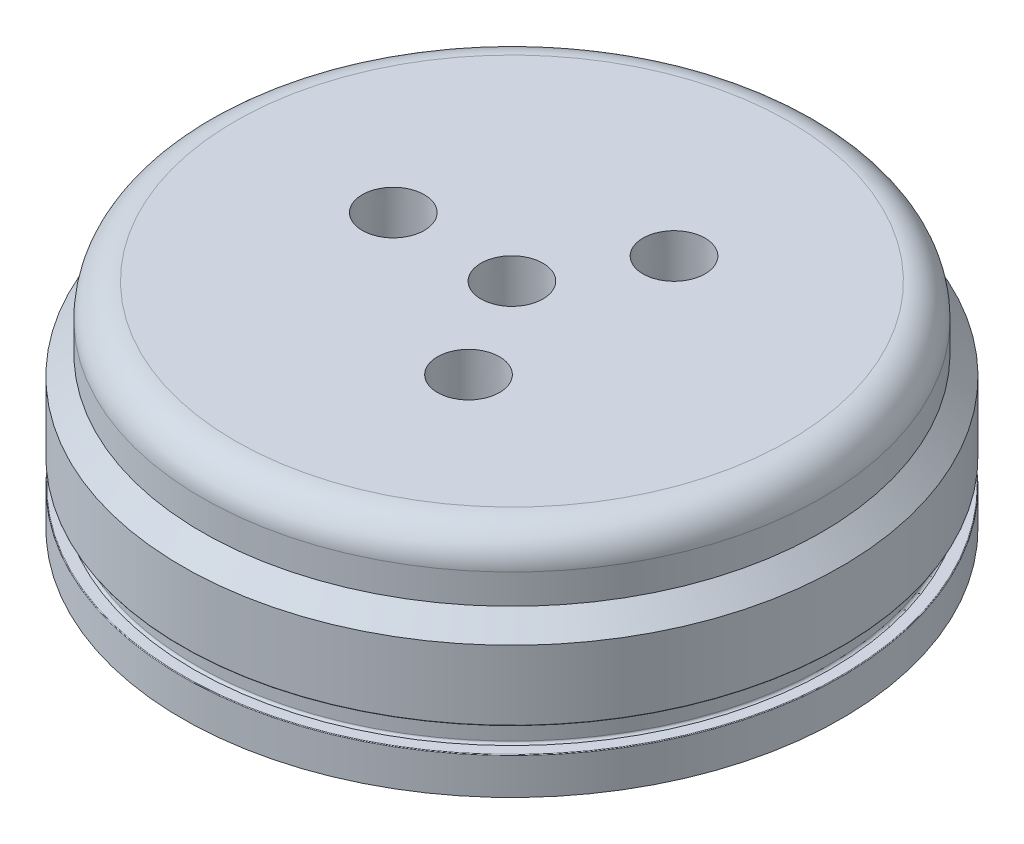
ISO-10303-21;
HEADER;
FILE_DESCRIPTION(('STEP AP214'),'2;1');
FILE_NAME('part.step','',(''),(''),'','','');
FILE_SCHEMA(('AUTOMOTIVE_DESIGN { 1 0 10303 214 1 1 1 1 }'));
ENDSEC;
DATA;
#1=APPLICATION_CONTEXT('core data for automotive mechanical design processes');
#2=APPLICATION_PROTOCOL_DEFINITION('international standard','automotive_design',2000,#1);
#3=PRODUCT_CONTEXT('',#1,'mechanical');
#4=PRODUCT('Part','Part','',(#3));
#5=PRODUCT_RELATED_PRODUCT_CATEGORY('part','',(#4));
#6=PRODUCT_DEFINITION_FORMATION('','',#4);
#7=PRODUCT_DEFINITION_CONTEXT('part definition',#1,'design');
#8=PRODUCT_DEFINITION('design','',#6,#7);
#9=PRODUCT_DEFINITION_SHAPE('','',#8);
#10=(LENGTH_UNIT() NAMED_UNIT(*) SI_UNIT(.MILLI.,.METRE.));
#11=(NAMED_UNIT(*) PLANE_ANGLE_UNIT() SI_UNIT($,.RADIAN.));
#12=(NAMED_UNIT(*) SI_UNIT($,.STERADIAN.) SOLID_ANGLE_UNIT());
#13=UNCERTAINTY_MEASURE_WITH_UNIT(LENGTH_MEASURE(1.E-05),#10,'distance_accuracy_value','');
#14=(GEOMETRIC_REPRESENTATION_CONTEXT(3) GLOBAL_UNCERTAINTY_ASSIGNED_CONTEXT((#13)) GLOBAL_UNIT_ASSIGNED_CONTEXT((#10,
#11,#12)) REPRESENTATION_CONTEXT('',''));
#15=CARTESIAN_POINT('',(0.,0.,0.));
#16=DIRECTION('',(0.,0.,1.));
#17=DIRECTION('',(1.,0.,0.));
#18=AXIS2_PLACEMENT_3D('',#15,#16,#17);
#19=CARTESIAN_POINT('',(-59.69,41.275,0.));
#20=DIRECTION('',(0.,-1.,0.));
#21=DIRECTION('',(0.,0.,-1.));
#22=AXIS2_PLACEMENT_3D('',#19,#20,#21);
#23=PLANE('',#22);
#24=CARTESIAN_POINT('',(0.,41.275,0.));
#25=DIRECTION('',(0.,-1.,0.));
#26=DIRECTION('',(0.,0.,-1.));
#27=AXIS2_PLACEMENT_3D('',#24,#25,#26);
#28=CIRCLE('',#27,5.97790349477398);
#29=CARTESIAN_POINT('',(0.,41.275,-5.97790349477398));
#30=VERTEX_POINT('',#29);
#31=EDGE_CURVE('E51',#30,#30,#28,.T.);
#32=ORIENTED_EDGE('',*,*,#31,.T.);
#33=EDGE_LOOP('',(#32));
#34=FACE_BOUND('',#33,.T.);
#35=CARTESIAN_POINT('',(0.,41.275,0.));
#36=DIRECTION('',(0.,-1.,0.));
#37=DIRECTION('',(0.,0.,-1.));
#38=AXIS2_PLACEMENT_3D('',#35,#36,#37);
#39=CIRCLE('',#38,53.34);
#40=CARTESIAN_POINT('',(0.,41.275,-53.34));
#41=VERTEX_POINT('',#40);
#42=EDGE_CURVE('E11',#41,#41,#39,.F.);
#43=ORIENTED_EDGE('',*,*,#42,.T.);
#44=EDGE_LOOP('',(#43));
#45=FACE_BOUND('',#44,.T.);
#46=CARTESIAN_POINT('',(11.4299999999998,41.275,19.7973407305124));
#47=DIRECTION('',(0.,-1.,0.));
#48=DIRECTION('',(0.,0.,-1.));
#49=AXIS2_PLACEMENT_3D('',#46,#47,#48);
#50=CIRCLE('',#49,5.97790349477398);
#51=CARTESIAN_POINT('',(11.4299999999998,41.275,13.8194372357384));
#52=VERTEX_POINT('',#51);
#53=EDGE_CURVE('E177',#52,#52,#50,.T.);
#54=ORIENTED_EDGE('',*,*,#53,.T.);
#55=EDGE_LOOP('',(#54));
#56=FACE_BOUND('',#55,.T.);
#57=CARTESIAN_POINT('',(11.4300000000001,41.275,-19.7973407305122));
#58=DIRECTION('',(0.,-1.,0.));
#59=DIRECTION('',(0.,0.,-1.));
#60=AXIS2_PLACEMENT_3D('',#57,#58,#59);
#61=CIRCLE('',#60,5.97790349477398);
#62=CARTESIAN_POINT('',(11.4300000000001,41.275,-25.7752442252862));
#63=VERTEX_POINT('',#62);
#64=EDGE_CURVE('E181',#63,#63,#61,.T.);
#65=ORIENTED_EDGE('',*,*,#64,.T.);
#66=EDGE_LOOP('',(#65));
#67=FACE_BOUND('',#66,.T.);
#68=CARTESIAN_POINT('',(-22.86,41.275,0.));
#69=DIRECTION('',(0.,-1.,0.));
#70=DIRECTION('',(0.,0.,-1.));
#71=AXIS2_PLACEMENT_3D('',#68,#69,#70);
#72=CIRCLE('',#71,5.97790349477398);
#73=CARTESIAN_POINT('',(-22.86,41.275,-5.97790349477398));
#74=VERTEX_POINT('',#73);
#75=EDGE_CURVE('E187',#74,#74,#72,.T.);
#76=ORIENTED_EDGE('',*,*,#75,.T.);
#77=EDGE_LOOP('',(#76));
#78=FACE_BOUND('',#77,.T.);
#79=ADVANCED_FACE('F47',(#34,#45,#56,#67,#78),#23,.F.);
#80=CARTESIAN_POINT('',(-55.7784,0.,0.));
#81=DIRECTION('',(0.,1.,0.));
#82=DIRECTION('',(0.,0.,1.));
#83=AXIS2_PLACEMENT_3D('',#80,#81,#82);
#84=PLANE('',#83);
#85=CARTESIAN_POINT('',(-8.85182948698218,0.,58.0666773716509));
#86=DIRECTION('',(0.,-1.,0.));
#87=DIRECTION('',(0.,0.,-1.));
#88=AXIS2_PLACEMENT_3D('',#85,#86,#87);
#89=CIRCLE('',#88,1.72719999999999);
#90=CARTESIAN_POINT('',(-8.85182948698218,0.,56.3394773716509));
#91=VERTEX_POINT('',#90);
#92=EDGE_CURVE('E103',#91,#91,#89,.T.);
#93=ORIENTED_EDGE('',*,*,#92,.F.);
#94=EDGE_LOOP('',(#93));
#95=FACE_BOUND('',#94,.T.);
#96=CARTESIAN_POINT('',(52.4893261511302,0.,26.3621802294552));
#97=DIRECTION('',(0.,-1.,0.));
#98=DIRECTION('',(0.,0.,-1.));
#99=AXIS2_PLACEMENT_3D('',#96,#97,#98);
#100=CIRCLE('',#99,1.72719999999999);
#101=CARTESIAN_POINT('',(52.4893261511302,0.,24.6349802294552));
#102=VERTEX_POINT('',#101);
#103=EDGE_CURVE('E124',#102,#102,#100,.T.);
#104=ORIENTED_EDGE('',*,*,#103,.F.);
#105=EDGE_LOOP('',(#104));
#106=FACE_BOUND('',#105,.T.);
#107=CARTESIAN_POINT('',(52.4893261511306,0.,-26.3621802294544));
#108=DIRECTION('',(0.,-1.,0.));
#109=DIRECTION('',(0.,0.,-1.));
#110=AXIS2_PLACEMENT_3D('',#107,#108,#109);
#111=CIRCLE('',#110,1.72719999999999);
#112=CARTESIAN_POINT('',(52.4893261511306,0.,-28.0893802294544));
#113=VERTEX_POINT('',#112);
#114=EDGE_CURVE('E132',#113,#113,#111,.T.);
#115=ORIENTED_EDGE('',*,*,#114,.F.);
#116=EDGE_LOOP('',(#115));
#117=FACE_BOUND('',#116,.T.);
#118=CARTESIAN_POINT('',(41.2920170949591,0.,-41.7739539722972));
#119=DIRECTION('',(0.,-1.,0.));
#120=DIRECTION('',(0.,0.,-1.));
#121=AXIS2_PLACEMENT_3D('',#118,#119,#120);
#122=CIRCLE('',#121,1.72719999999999);
#123=CARTESIAN_POINT('',(41.2920170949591,0.,-43.5011539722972));
#124=VERTEX_POINT('',#123);
#125=EDGE_CURVE('E138',#124,#124,#122,.T.);
#126=ORIENTED_EDGE('',*,*,#125,.F.);
#127=EDGE_LOOP('',(#126));
#128=FACE_BOUND('',#127,.T.);
#129=CARTESIAN_POINT('',(-8.85182948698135,0.,-58.066677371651));
#130=DIRECTION('',(0.,-1.,0.));
#131=DIRECTION('',(0.,0.,-1.));
#132=AXIS2_PLACEMENT_3D('',#129,#130,#131);
#133=CIRCLE('',#132,1.72719999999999);
#134=CARTESIAN_POINT('',(-8.85182948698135,0.,-59.793877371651));
#135=VERTEX_POINT('',#134);
#136=EDGE_CURVE('E144',#135,#135,#133,.T.);
#137=ORIENTED_EDGE('',*,*,#136,.F.);
#138=EDGE_LOOP('',(#137));
#139=FACE_BOUND('',#138,.T.);
#140=CARTESIAN_POINT('',(-26.9694561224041,0.,-52.1799036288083));
#141=DIRECTION('',(0.,-1.,0.));
#142=DIRECTION('',(0.,0.,-1.));
#143=AXIS2_PLACEMENT_3D('',#140,#141,#142);
#144=CIRCLE('',#143,1.72719999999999);
#145=CARTESIAN_POINT('',(-26.9694561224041,0.,-53.9071036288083));
#146=VERTEX_POINT('',#145);
#147=EDGE_CURVE('E150',#146,#146,#144,.T.);
#148=ORIENTED_EDGE('',*,*,#147,.F.);
#149=EDGE_LOOP('',(#148));
#150=FACE_BOUND('',#149,.T.);
#151=CARTESIAN_POINT('',(-57.9600576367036,0.,-9.525));
#152=DIRECTION('',(0.,-1.,0.));
#153=DIRECTION('',(0.,0.,-1.));
#154=AXIS2_PLACEMENT_3D('',#151,#152,#153);
#155=CIRCLE('',#154,1.72719999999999);
#156=CARTESIAN_POINT('',(-57.9600576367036,0.,-11.2522));
#157=VERTEX_POINT('',#156);
#158=EDGE_CURVE('E157',#157,#157,#155,.T.);
#159=ORIENTED_EDGE('',*,*,#158,.F.);
#160=EDGE_LOOP('',(#159));
#161=FACE_BOUND('',#160,.T.);
#162=CARTESIAN_POINT('',(-57.9600576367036,0.,9.525));
#163=DIRECTION('',(0.,-1.,0.));
#164=DIRECTION('',(0.,0.,-1.));
#165=AXIS2_PLACEMENT_3D('',#162,#163,#164);
#166=CIRCLE('',#165,1.72719999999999);
#167=CARTESIAN_POINT('',(-57.9600576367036,0.,7.79780000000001));
#168=VERTEX_POINT('',#167);
#169=EDGE_CURVE('E165',#168,#168,#166,.T.);
#170=ORIENTED_EDGE('',*,*,#169,.F.);
#171=EDGE_LOOP('',(#170));
#172=FACE_BOUND('',#171,.T.);
#173=CARTESIAN_POINT('',(0.,0.,0.));
#174=DIRECTION('',(0.,-1.,0.));
#175=DIRECTION('',(0.,0.,-1.));
#176=AXIS2_PLACEMENT_3D('',#173,#174,#175);
#177=CIRCLE('',#176,55.7784);
#178=CARTESIAN_POINT('',(0.,0.,-55.7784));
#179=VERTEX_POINT('',#178);
#180=EDGE_CURVE('E207',#179,#179,#177,.T.);
#181=ORIENTED_EDGE('',*,*,#180,.F.);
#182=EDGE_LOOP('',(#181));
#183=FACE_BOUND('',#182,.T.);
#184=CARTESIAN_POINT('',(0.,0.,0.));
#185=DIRECTION('',(0.,-1.,0.));
#186=DIRECTION('',(0.,0.,-1.));
#187=AXIS2_PLACEMENT_3D('',#184,#185,#186);
#188=CIRCLE('',#187,63.5);
#189=CARTESIAN_POINT('',(0.,0.,-63.5));
#190=VERTEX_POINT('',#189);
#191=EDGE_CURVE('E203',#190,#190,#188,.T.);
#192=ORIENTED_EDGE('',*,*,#191,.T.);
#193=EDGE_LOOP('',(#192));
#194=FACE_BOUND('',#193,.T.);
#195=CARTESIAN_POINT('',(41.2920170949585,0.,41.7739539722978));
#196=DIRECTION('',(0.,-1.,0.));
#197=DIRECTION('',(0.,0.,-1.));
#198=AXIS2_PLACEMENT_3D('',#195,#196,#197);
#199=CIRCLE('',#198,1.72719999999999);
#200=CARTESIAN_POINT('',(41.2920170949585,0.,40.0467539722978));
#201=VERTEX_POINT('',#200);
#202=EDGE_CURVE('E116',#201,#201,#199,.T.);
#203=ORIENTED_EDGE('',*,*,#202,.F.);
#204=EDGE_LOOP('',(#203));
#205=FACE_BOUND('',#204,.T.);
#206=CARTESIAN_POINT('',(-26.9694561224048,0.,52.1799036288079));
#207=DIRECTION('',(0.,-1.,0.));
#208=DIRECTION('',(0.,0.,-1.));
#209=AXIS2_PLACEMENT_3D('',#206,#207,#208);
#210=CIRCLE('',#209,1.72719999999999);
#211=CARTESIAN_POINT('',(-26.9694561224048,0.,50.4527036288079));
#212=VERTEX_POINT('',#211);
#213=EDGE_CURVE('E104',#212,#212,#210,.T.);
#214=ORIENTED_EDGE('',*,*,#213,.F.);
#215=EDGE_LOOP('',(#214));
#216=FACE_BOUND('',#215,.T.);
#217=ADVANCED_FACE('F272',(#95,#106,#117,#128,#139,#150,#161,#172,#183,#194,#205,#216),#84,.F.);
#218=CARTESIAN_POINT('',(0.,7.5565,0.));
#219=DIRECTION('',(0.,-1.,0.));
#220=DIRECTION('',(0.,0.,-1.));
#221=AXIS2_PLACEMENT_3D('',#218,#219,#220);
#222=TOROIDAL_SURFACE('',#221,61.3029,0.4445);
#223=CARTESIAN_POINT('',(0.,7.112,0.));
#224=DIRECTION('',(0.,-1.,0.));
#225=DIRECTION('',(0.,0.,-1.));
#226=AXIS2_PLACEMENT_3D('',#223,#224,#225);
#227=CIRCLE('',#226,61.3029);
#228=CARTESIAN_POINT('',(0.,7.112,-61.3029));
#229=VERTEX_POINT('',#228);
#230=EDGE_CURVE('E191',#229,#229,#227,.T.);
#231=ORIENTED_EDGE('',*,*,#230,.F.);
#232=EDGE_LOOP('',(#231));
#233=FACE_BOUND('',#232,.T.);
#234=CARTESIAN_POINT('',(0.,7.5565,0.));
#235=DIRECTION('',(0.,-1.,0.));
#236=DIRECTION('',(0.,0.,-1.));
#237=AXIS2_PLACEMENT_3D('',#234,#235,#236);
#238=CIRCLE('',#237,60.8584);
#239=CARTESIAN_POINT('',(0.,7.5565,-60.8584));
#240=VERTEX_POINT('',#239);
#241=EDGE_CURVE('E243',#240,#240,#238,.T.);
#242=ORIENTED_EDGE('',*,*,#241,.T.);
#243=EDGE_LOOP('',(#242));
#244=FACE_BOUND('',#243,.T.);
#245=ADVANCED_FACE('F278',(#233,#244),#222,.F.);
#246=CARTESIAN_POINT('',(0.,0.,0.));
#247=DIRECTION('',(0.,-1.,0.));
#248=DIRECTION('',(0.,0.,-1.));
#249=AXIS2_PLACEMENT_3D('',#246,#247,#248);
#250=CYLINDRICAL_SURFACE('',#249,60.8584);
#251=ORIENTED_EDGE('',*,*,#241,.F.);
#252=EDGE_LOOP('',(#251));
#253=FACE_BOUND('',#252,.T.);
#254=CARTESIAN_POINT('',(0.,11.4935,0.));
#255=DIRECTION('',(0.,-1.,0.));
#256=DIRECTION('',(0.,0.,-1.));
#257=AXIS2_PLACEMENT_3D('',#254,#255,#256);
#258=CIRCLE('',#257,60.8584);
#259=CARTESIAN_POINT('',(0.,11.4935,-60.8584));
#260=VERTEX_POINT('',#259);
#261=EDGE_CURVE('E239',#260,#260,#258,.T.);
#262=ORIENTED_EDGE('',*,*,#261,.T.);
#263=EDGE_LOOP('',(#262));
#264=FACE_BOUND('',#263,.T.);
#265=ADVANCED_FACE('F308',(#253,#264),#250,.T.);
#266=CARTESIAN_POINT('',(0.,11.4935,0.));
#267=DIRECTION('',(0.,-1.,0.));
#268=DIRECTION('',(0.,0.,-1.));
#269=AXIS2_PLACEMENT_3D('',#266,#267,#268);
#270=TOROIDAL_SURFACE('',#269,61.3029,0.4445);
#271=ORIENTED_EDGE('',*,*,#261,.F.);
#272=EDGE_LOOP('',(#271));
#273=FACE_BOUND('',#272,.T.);
#274=CARTESIAN_POINT('',(0.,11.938,0.));
#275=DIRECTION('',(0.,-1.,0.));
#276=DIRECTION('',(0.,0.,-1.));
#277=AXIS2_PLACEMENT_3D('',#274,#275,#276);
#278=CIRCLE('',#277,61.3029);
#279=CARTESIAN_POINT('',(0.,11.938,-61.3029));
#280=VERTEX_POINT('',#279);
#281=EDGE_CURVE('E235',#280,#280,#278,.T.);
#282=ORIENTED_EDGE('',*,*,#281,.T.);
#283=EDGE_LOOP('',(#282));
#284=FACE_BOUND('',#283,.T.);
#285=ADVANCED_FACE('F304',(#273,#284),#270,.F.);
#286=CARTESIAN_POINT('',(-63.373,11.938,0.));
#287=DIRECTION('',(0.,1.,0.));
#288=DIRECTION('',(0.,0.,1.));
#289=AXIS2_PLACEMENT_3D('',#286,#287,#288);
#290=PLANE('',#289);
#291=ORIENTED_EDGE('',*,*,#281,.F.);
#292=EDGE_LOOP('',(#291));
#293=FACE_BOUND('',#292,.T.);
#294=CARTESIAN_POINT('',(0.,11.938,0.));
#295=DIRECTION('',(0.,-1.,0.));
#296=DIRECTION('',(0.,0.,-1.));
#297=AXIS2_PLACEMENT_3D('',#294,#295,#296);
#298=CIRCLE('',#297,63.373);
#299=CARTESIAN_POINT('',(0.,11.938,-63.373));
#300=VERTEX_POINT('',#299);
#301=EDGE_CURVE('E231',#300,#300,#298,.T.);
#302=ORIENTED_EDGE('',*,*,#301,.T.);
#303=EDGE_LOOP('',(#302));
#304=FACE_BOUND('',#303,.T.);
#305=ADVANCED_FACE('F300',(#293,#304),#290,.F.);
#306=CARTESIAN_POINT('',(0.,12.065,0.));
#307=DIRECTION('',(0.,-1.,0.));
#308=DIRECTION('',(0.,0.,-1.));
#309=AXIS2_PLACEMENT_3D('',#306,#307,#308);
#310=TOROIDAL_SURFACE('',#309,63.373,0.127);
#311=ORIENTED_EDGE('',*,*,#301,.F.);
#312=EDGE_LOOP('',(#311));
#313=FACE_BOUND('',#312,.T.);
#314=CARTESIAN_POINT('',(0.,12.065,0.));
#315=DIRECTION('',(0.,-1.,0.));
#316=DIRECTION('',(0.,0.,-1.));
#317=AXIS2_PLACEMENT_3D('',#314,#315,#316);
#318=CIRCLE('',#317,63.5);
#319=CARTESIAN_POINT('',(0.,12.065,-63.5));
#320=VERTEX_POINT('',#319);
#321=EDGE_CURVE('E227',#320,#320,#318,.T.);
#322=ORIENTED_EDGE('',*,*,#321,.T.);
#323=EDGE_LOOP('',(#322));
#324=FACE_BOUND('',#323,.T.);
#325=ADVANCED_FACE('F296',(#313,#324),#310,.T.);
#326=CARTESIAN_POINT('',(0.,0.,0.));
#327=DIRECTION('',(0.,-1.,0.));
#328=DIRECTION('',(0.,0.,-1.));
#329=AXIS2_PLACEMENT_3D('',#326,#327,#328);
#330=CYLINDRICAL_SURFACE('',#329,63.5);
#331=ORIENTED_EDGE('',*,*,#321,.F.);
#332=EDGE_LOOP('',(#331));
#333=FACE_BOUND('',#332,.T.);
#334=CARTESIAN_POINT('',(0.,25.4,0.));
#335=DIRECTION('',(0.,-1.,0.));
#336=DIRECTION('',(0.,0.,-1.));
#337=AXIS2_PLACEMENT_3D('',#334,#335,#336);
#338=CIRCLE('',#337,63.5);
#339=CARTESIAN_POINT('',(0.,25.4,-63.5));
#340=VERTEX_POINT('',#339);
#341=EDGE_CURVE('E223',#340,#340,#338,.T.);
#342=ORIENTED_EDGE('',*,*,#341,.T.);
#343=EDGE_LOOP('',(#342));
#344=FACE_BOUND('',#343,.T.);
#345=ADVANCED_FACE('F292',(#333,#344),#330,.T.);
#346=CARTESIAN_POINT('',(0.,29.21,0.));
#347=DIRECTION('',(0.,-1.,0.));
#348=DIRECTION('',(0.,0.,-1.));
#349=AXIS2_PLACEMENT_3D('',#346,#347,#348);
#350=CONICAL_SURFACE('',#349,59.69,0.78539816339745);
#351=ORIENTED_EDGE('',*,*,#341,.F.);
#352=EDGE_LOOP('',(#351));
#353=FACE_BOUND('',#352,.T.);
#354=CARTESIAN_POINT('',(0.,29.21,0.));
#355=DIRECTION('',(0.,-1.,0.));
#356=DIRECTION('',(0.,0.,-1.));
#357=AXIS2_PLACEMENT_3D('',#354,#355,#356);
#358=CIRCLE('',#357,59.69);
#359=CARTESIAN_POINT('',(0.,29.21,-59.69));
#360=VERTEX_POINT('',#359);
#361=EDGE_CURVE('E219',#360,#360,#358,.T.);
#362=ORIENTED_EDGE('',*,*,#361,.T.);
#363=EDGE_LOOP('',(#362));
#364=FACE_BOUND('',#363,.T.);
#365=ADVANCED_FACE('F289',(#353,#364),#350,.T.);
#366=CARTESIAN_POINT('',(0.,0.,0.));
#367=DIRECTION('',(0.,-1.,0.));
#368=DIRECTION('',(0.,0.,-1.));
#369=AXIS2_PLACEMENT_3D('',#366,#367,#368);
#370=CYLINDRICAL_SURFACE('',#369,59.69);
#371=CARTESIAN_POINT('',(0.,34.925,0.));
#372=DIRECTION('',(0.,-1.,0.));
#373=DIRECTION('',(0.,0.,-1.));
#374=AXIS2_PLACEMENT_3D('',#371,#372,#373);
#375=CIRCLE('',#374,59.69);
#376=CARTESIAN_POINT('',(0.,34.925,-59.69));
#377=VERTEX_POINT('',#376);
#378=EDGE_CURVE('E57',#377,#377,#375,.T.);
#379=ORIENTED_EDGE('',*,*,#378,.T.);
#380=EDGE_LOOP('',(#379));
#381=FACE_BOUND('',#380,.T.);
#382=ORIENTED_EDGE('',*,*,#361,.F.);
#383=EDGE_LOOP('',(#382));
#384=FACE_BOUND('',#383,.T.);
#385=ADVANCED_FACE('F254',(#381,#384),#370,.T.);
#386=CARTESIAN_POINT('',(-47.0429294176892,32.385,0.));
#387=DIRECTION('',(0.,1.,0.));
#388=DIRECTION('',(0.,0.,1.));
#389=AXIS2_PLACEMENT_3D('',#386,#387,#388);
#390=PLANE('',#389);
#391=CARTESIAN_POINT('',(0.,32.385,0.));
#392=DIRECTION('',(0.,-1.,0.));
#393=DIRECTION('',(0.,0.,-1.));
#394=AXIS2_PLACEMENT_3D('',#391,#392,#393);
#395=CIRCLE('',#394,6.244082);
#396=CARTESIAN_POINT('',(0.,32.385,-6.244082));
#397=VERTEX_POINT('',#396);
#398=EDGE_CURVE('E810',#397,#397,#395,.T.);
#399=ORIENTED_EDGE('',*,*,#398,.F.);
#400=EDGE_LOOP('',(#399));
#401=FACE_BOUND('',#400,.T.);
#402=CARTESIAN_POINT('',(11.4299999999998,32.385,19.7973407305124));
#403=DIRECTION('',(0.,-1.,0.));
#404=DIRECTION('',(0.,0.,-1.));
#405=AXIS2_PLACEMENT_3D('',#402,#403,#404);
#406=CIRCLE('',#405,6.244082);
#407=CARTESIAN_POINT('',(11.4299999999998,32.385,13.5532587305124));
#408=VERTEX_POINT('',#407);
#409=EDGE_CURVE('E173',#408,#408,#406,.T.);
#410=ORIENTED_EDGE('',*,*,#409,.F.);
#411=EDGE_LOOP('',(#410));
#412=FACE_BOUND('',#411,.T.);
#413=CARTESIAN_POINT('',(11.4300000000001,32.385,-19.7973407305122));
#414=DIRECTION('',(0.,-1.,0.));
#415=DIRECTION('',(0.,0.,-1.));
#416=AXIS2_PLACEMENT_3D('',#413,#414,#415);
#417=CIRCLE('',#416,6.244082);
#418=CARTESIAN_POINT('',(11.4300000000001,32.385,-26.0414227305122));
#419=VERTEX_POINT('',#418);
#420=EDGE_CURVE('E178',#419,#419,#417,.T.);
#421=ORIENTED_EDGE('',*,*,#420,.F.);
#422=EDGE_LOOP('',(#421));
#423=FACE_BOUND('',#422,.T.);
#424=CARTESIAN_POINT('',(-22.86,32.385,0.));
#425=DIRECTION('',(0.,-1.,0.));
#426=DIRECTION('',(0.,0.,-1.));
#427=AXIS2_PLACEMENT_3D('',#424,#425,#426);
#428=CIRCLE('',#427,6.244082);
#429=CARTESIAN_POINT('',(-22.86,32.385,-6.244082));
#430=VERTEX_POINT('',#429);
#431=EDGE_CURVE('E184',#430,#430,#428,.T.);
#432=ORIENTED_EDGE('',*,*,#431,.F.);
#433=EDGE_LOOP('',(#432));
#434=FACE_BOUND('',#433,.T.);
#435=CARTESIAN_POINT('',(0.,32.385,0.));
#436=DIRECTION('',(0.,-1.,0.));
#437=DIRECTION('',(0.,0.,-1.));
#438=AXIS2_PLACEMENT_3D('',#435,#436,#437);
#439=CIRCLE('',#438,47.0429294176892);
#440=CARTESIAN_POINT('',(0.,32.385,-47.0429294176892));
#441=VERTEX_POINT('',#440);
#442=EDGE_CURVE('E215',#441,#441,#439,.T.);
#443=ORIENTED_EDGE('',*,*,#442,.T.);
#444=EDGE_LOOP('',(#443));
#445=FACE_BOUND('',#444,.T.);
#446=ADVANCED_FACE('F285',(#401,#412,#423,#434,#445),#390,.F.);
#447=CARTESIAN_POINT('',(0.,23.6495294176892,0.));
#448=DIRECTION('',(0.,-1.,0.));
#449=DIRECTION('',(0.,0.,-1.));
#450=AXIS2_PLACEMENT_3D('',#447,#448,#449);
#451=TOROIDAL_SURFACE('',#450,47.0429294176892,8.73547058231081);
#452=ORIENTED_EDGE('',*,*,#442,.F.);
#453=EDGE_LOOP('',(#452));
#454=FACE_BOUND('',#453,.T.);
#455=CARTESIAN_POINT('',(0.,23.6495294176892,0.));
#456=DIRECTION('',(0.,-1.,0.));
#457=DIRECTION('',(0.,0.,-1.));
#458=AXIS2_PLACEMENT_3D('',#455,#456,#457);
#459=CIRCLE('',#458,55.7784);
#460=CARTESIAN_POINT('',(0.,23.6495294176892,-55.7784));
#461=VERTEX_POINT('',#460);
#462=EDGE_CURVE('E211',#461,#461,#459,.T.);
#463=ORIENTED_EDGE('',*,*,#462,.T.);
#464=EDGE_LOOP('',(#463));
#465=FACE_BOUND('',#464,.T.);
#466=ADVANCED_FACE('F355',(#454,#465),#451,.F.);
#467=CARTESIAN_POINT('',(0.,0.,0.));
#468=DIRECTION('',(0.,-1.,0.));
#469=DIRECTION('',(0.,0.,-1.));
#470=AXIS2_PLACEMENT_3D('',#467,#468,#469);
#471=CYLINDRICAL_SURFACE('',#470,55.7784);
#472=ORIENTED_EDGE('',*,*,#462,.F.);
#473=EDGE_LOOP('',(#472));
#474=FACE_BOUND('',#473,.T.);
#475=ORIENTED_EDGE('',*,*,#180,.T.);
#476=EDGE_LOOP('',(#475));
#477=FACE_BOUND('',#476,.T.);
#478=ADVANCED_FACE('F351',(#474,#477),#471,.F.);
#479=CARTESIAN_POINT('',(0.,0.,0.));
#480=DIRECTION('',(0.,-1.,0.));
#481=DIRECTION('',(0.,0.,-1.));
#482=AXIS2_PLACEMENT_3D('',#479,#480,#481);
#483=CYLINDRICAL_SURFACE('',#482,63.5);
#484=ORIENTED_EDGE('',*,*,#191,.F.);
#485=EDGE_LOOP('',(#484));
#486=FACE_BOUND('',#485,.T.);
#487=CARTESIAN_POINT('',(0.,6.985,0.));
#488=DIRECTION('',(0.,-1.,0.));
#489=DIRECTION('',(0.,0.,-1.));
#490=AXIS2_PLACEMENT_3D('',#487,#488,#489);
#491=CIRCLE('',#490,63.5);
#492=CARTESIAN_POINT('',(0.,6.985,-63.5));
#493=VERTEX_POINT('',#492);
#494=EDGE_CURVE('E199',#493,#493,#491,.T.);
#495=ORIENTED_EDGE('',*,*,#494,.T.);
#496=EDGE_LOOP('',(#495));
#497=FACE_BOUND('',#496,.T.);
#498=ADVANCED_FACE('F344',(#486,#497),#483,.T.);
#499=CARTESIAN_POINT('',(0.,6.985,0.));
#500=DIRECTION('',(0.,-1.,0.));
#501=DIRECTION('',(0.,0.,-1.));
#502=AXIS2_PLACEMENT_3D('',#499,#500,#501);
#503=TOROIDAL_SURFACE('',#502,63.373,0.127);
#504=ORIENTED_EDGE('',*,*,#494,.F.);
#505=EDGE_LOOP('',(#504));
#506=FACE_BOUND('',#505,.T.);
#507=CARTESIAN_POINT('',(0.,7.112,0.));
#508=DIRECTION('',(0.,-1.,0.));
#509=DIRECTION('',(0.,0.,-1.));
#510=AXIS2_PLACEMENT_3D('',#507,#508,#509);
#511=CIRCLE('',#510,63.373);
#512=CARTESIAN_POINT('',(0.,7.112,-63.373));
#513=VERTEX_POINT('',#512);
#514=EDGE_CURVE('E195',#513,#513,#511,.T.);
#515=ORIENTED_EDGE('',*,*,#514,.T.);
#516=EDGE_LOOP('',(#515));
#517=FACE_BOUND('',#516,.T.);
#518=ADVANCED_FACE('F335',(#506,#517),#503,.T.);
#519=CARTESIAN_POINT('',(-61.3029,7.112,0.));
#520=DIRECTION('',(0.,-1.,0.));
#521=DIRECTION('',(0.,0.,-1.));
#522=AXIS2_PLACEMENT_3D('',#519,#520,#521);
#523=PLANE('',#522);
#524=ORIENTED_EDGE('',*,*,#514,.F.);
#525=EDGE_LOOP('',(#524));
#526=FACE_BOUND('',#525,.T.);
#527=ORIENTED_EDGE('',*,*,#230,.T.);
#528=EDGE_LOOP('',(#527));
#529=FACE_BOUND('',#528,.T.);
#530=ADVANCED_FACE('F332',(#526,#529),#523,.F.);
#531=CARTESIAN_POINT('',(-22.86,32.385,0.));
#532=DIRECTION('',(0.,-1.,0.));
#533=DIRECTION('',(0.,0.,-1.));
#534=AXIS2_PLACEMENT_3D('',#531,#532,#533);
#535=CONICAL_SURFACE('',#534,6.244082,0.0299323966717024);
#536=ORIENTED_EDGE('',*,*,#431,.T.);
#537=EDGE_LOOP('',(#536));
#538=FACE_BOUND('',#537,.T.);
#539=ORIENTED_EDGE('',*,*,#75,.F.);
#540=EDGE_LOOP('',(#539));
#541=FACE_BOUND('',#540,.T.);
#542=ADVANCED_FACE('F334',(#538,#541),#535,.F.);
#543=CARTESIAN_POINT('',(11.4300000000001,32.385,-19.7973407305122));
#544=DIRECTION('',(0.,-1.,0.));
#545=DIRECTION('',(0.,0.,-1.));
#546=AXIS2_PLACEMENT_3D('',#543,#544,#545);
#547=CONICAL_SURFACE('',#546,6.244082,0.0299323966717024);
#548=ORIENTED_EDGE('',*,*,#420,.T.);
#549=EDGE_LOOP('',(#548));
#550=FACE_BOUND('',#549,.T.);
#551=ORIENTED_EDGE('',*,*,#64,.F.);
#552=EDGE_LOOP('',(#551));
#553=FACE_BOUND('',#552,.T.);
#554=ADVANCED_FACE('F267',(#550,#553),#547,.F.);
#555=CARTESIAN_POINT('',(11.4299999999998,32.385,19.7973407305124));
#556=DIRECTION('',(0.,-1.,0.));
#557=DIRECTION('',(0.,0.,-1.));
#558=AXIS2_PLACEMENT_3D('',#555,#556,#557);
#559=CONICAL_SURFACE('',#558,6.244082,0.0299323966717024);
#560=ORIENTED_EDGE('',*,*,#409,.T.);
#561=EDGE_LOOP('',(#560));
#562=FACE_BOUND('',#561,.T.);
#563=ORIENTED_EDGE('',*,*,#53,.F.);
#564=EDGE_LOOP('',(#563));
#565=FACE_BOUND('',#564,.T.);
#566=ADVANCED_FACE('F259',(#562,#565),#559,.F.);
#567=CARTESIAN_POINT('',(0.,34.925,0.));
#568=DIRECTION('',(0.,-1.,0.));
#569=DIRECTION('',(0.,0.,-1.));
#570=AXIS2_PLACEMENT_3D('',#567,#568,#569);
#571=TOROIDAL_SURFACE('',#570,53.34,6.35);
#572=ORIENTED_EDGE('',*,*,#42,.F.);
#573=EDGE_LOOP('',(#572));
#574=FACE_BOUND('',#573,.T.);
#575=ORIENTED_EDGE('',*,*,#378,.F.);
#576=EDGE_LOOP('',(#575));
#577=FACE_BOUND('',#576,.T.);
#578=ADVANCED_FACE('F49',(#574,#577),#571,.T.);
#579=CARTESIAN_POINT('',(-57.9600576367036,12.2936,9.525));
#580=DIRECTION('',(0.,-1.,0.));
#581=DIRECTION('',(0.,0.,-1.));
#582=AXIS2_PLACEMENT_3D('',#579,#580,#581);
#583=CONICAL_SURFACE('',#582,1.7272,1.02974425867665);
#584=CARTESIAN_POINT('',(-57.9600576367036,13.3314064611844,9.525));
#585=VERTEX_POINT('',#584);
#586=VERTEX_LOOP('',#585);
#587=FACE_BOUND('',#586,.T.);
#588=CARTESIAN_POINT('',(-57.9600576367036,12.2936,9.525));
#589=DIRECTION('',(0.,-1.,0.));
#590=DIRECTION('',(0.,0.,-1.));
#591=AXIS2_PLACEMENT_3D('',#588,#589,#590);
#592=CIRCLE('',#591,1.7272);
#593=CARTESIAN_POINT('',(-57.9600576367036,12.2936,7.7978));
#594=VERTEX_POINT('',#593);
#595=EDGE_CURVE('E169',#594,#594,#592,.T.);
#596=ORIENTED_EDGE('',*,*,#595,.T.);
#597=EDGE_LOOP('',(#596));
#598=FACE_BOUND('',#597,.T.);
#599=ADVANCED_FACE('F258',(#587,#598),#583,.F.);
#600=CARTESIAN_POINT('',(-57.9600576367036,0.,9.525));
#601=DIRECTION('',(0.,-1.,0.));
#602=DIRECTION('',(0.,0.,-1.));
#603=AXIS2_PLACEMENT_3D('',#600,#601,#602);
#604=CYLINDRICAL_SURFACE('',#603,1.72719999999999);
#605=ORIENTED_EDGE('',*,*,#595,.F.);
#606=EDGE_LOOP('',(#605));
#607=FACE_BOUND('',#606,.T.);
#608=ORIENTED_EDGE('',*,*,#169,.T.);
#609=EDGE_LOOP('',(#608));
#610=FACE_BOUND('',#609,.T.);
#611=ADVANCED_FACE('F265',(#607,#610),#604,.F.);
#612=CARTESIAN_POINT('',(-57.9600576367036,12.2936,-9.525));
#613=DIRECTION('',(0.,-1.,0.));
#614=DIRECTION('',(0.,0.,-1.));
#615=AXIS2_PLACEMENT_3D('',#612,#613,#614);
#616=CONICAL_SURFACE('',#615,1.7272,1.02974425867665);
#617=CARTESIAN_POINT('',(-57.9600576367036,13.3314064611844,-9.525));
#618=VERTEX_POINT('',#617);
#619=VERTEX_LOOP('',#618);
#620=FACE_BOUND('',#619,.T.);
#621=CARTESIAN_POINT('',(-57.9600576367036,12.2936,-9.525));
#622=DIRECTION('',(0.,-1.,0.));
#623=DIRECTION('',(0.,0.,-1.));
#624=AXIS2_PLACEMENT_3D('',#621,#622,#623);
#625=CIRCLE('',#624,1.7272);
#626=CARTESIAN_POINT('',(-57.9600576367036,12.2936,-11.2522));
#627=VERTEX_POINT('',#626);
#628=EDGE_CURVE('E161',#627,#627,#625,.T.);
#629=ORIENTED_EDGE('',*,*,#628,.T.);
#630=EDGE_LOOP('',(#629));
#631=FACE_BOUND('',#630,.T.);
#632=ADVANCED_FACE('F443',(#620,#631),#616,.F.);
#633=CARTESIAN_POINT('',(-57.9600576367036,0.,-9.525));
#634=DIRECTION('',(0.,-1.,0.));
#635=DIRECTION('',(0.,0.,-1.));
#636=AXIS2_PLACEMENT_3D('',#633,#634,#635);
#637=CYLINDRICAL_SURFACE('',#636,1.72719999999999);
#638=ORIENTED_EDGE('',*,*,#628,.F.);
#639=EDGE_LOOP('',(#638));
#640=FACE_BOUND('',#639,.T.);
#641=ORIENTED_EDGE('',*,*,#158,.T.);
#642=EDGE_LOOP('',(#641));
#643=FACE_BOUND('',#642,.T.);
#644=ADVANCED_FACE('F439',(#640,#643),#637,.F.);
#645=CARTESIAN_POINT('',(-26.9694561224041,12.2936,-52.1799036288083));
#646=DIRECTION('',(0.,-1.,0.));
#647=DIRECTION('',(0.,0.,-1.));
#648=AXIS2_PLACEMENT_3D('',#645,#646,#647);
#649=CONICAL_SURFACE('',#648,1.7272,1.02974425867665);
#650=CARTESIAN_POINT('',(-26.9694561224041,13.3314064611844,-52.1799036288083));
#651=VERTEX_POINT('',#650);
#652=VERTEX_LOOP('',#651);
#653=FACE_BOUND('',#652,.T.);
#654=CARTESIAN_POINT('',(-26.9694561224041,12.2936,-52.1799036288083));
#655=DIRECTION('',(0.,-1.,0.));
#656=DIRECTION('',(0.,0.,-1.));
#657=AXIS2_PLACEMENT_3D('',#654,#655,#656);
#658=CIRCLE('',#657,1.7272);
#659=CARTESIAN_POINT('',(-26.9694561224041,12.2936,-53.9071036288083));
#660=VERTEX_POINT('',#659);
#661=EDGE_CURVE('E154',#660,#660,#658,.T.);
#662=ORIENTED_EDGE('',*,*,#661,.T.);
#663=EDGE_LOOP('',(#662));
#664=FACE_BOUND('',#663,.T.);
#665=ADVANCED_FACE('F435',(#653,#664),#649,.F.);
#666=CARTESIAN_POINT('',(-26.9694561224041,0.,-52.1799036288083));
#667=DIRECTION('',(0.,-1.,0.));
#668=DIRECTION('',(0.,0.,-1.));
#669=AXIS2_PLACEMENT_3D('',#666,#667,#668);
#670=CYLINDRICAL_SURFACE('',#669,1.72719999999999);
#671=ORIENTED_EDGE('',*,*,#661,.F.);
#672=EDGE_LOOP('',(#671));
#673=FACE_BOUND('',#672,.T.);
#674=ORIENTED_EDGE('',*,*,#147,.T.);
#675=EDGE_LOOP('',(#674));
#676=FACE_BOUND('',#675,.T.);
#677=ADVANCED_FACE('F431',(#673,#676),#670,.F.);
#678=CARTESIAN_POINT('',(-8.85182948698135,12.2936,-58.066677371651));
#679=DIRECTION('',(0.,-1.,0.));
#680=DIRECTION('',(0.,0.,-1.));
#681=AXIS2_PLACEMENT_3D('',#678,#679,#680);
#682=CONICAL_SURFACE('',#681,1.7272,1.02974425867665);
#683=CARTESIAN_POINT('',(-8.85182948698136,13.3314064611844,-58.066677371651));
#684=VERTEX_POINT('',#683);
#685=VERTEX_LOOP('',#684);
#686=FACE_BOUND('',#685,.T.);
#687=CARTESIAN_POINT('',(-8.85182948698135,12.2936,-58.066677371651));
#688=DIRECTION('',(0.,-1.,0.));
#689=DIRECTION('',(0.,0.,-1.));
#690=AXIS2_PLACEMENT_3D('',#687,#688,#689);
#691=CIRCLE('',#690,1.7272);
#692=CARTESIAN_POINT('',(-8.85182948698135,12.2936,-59.793877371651));
#693=VERTEX_POINT('',#692);
#694=EDGE_CURVE('E147',#693,#693,#691,.T.);
#695=ORIENTED_EDGE('',*,*,#694,.T.);
#696=EDGE_LOOP('',(#695));
#697=FACE_BOUND('',#696,.T.);
#698=ADVANCED_FACE('F427',(#686,#697),#682,.F.);
#699=CARTESIAN_POINT('',(-8.85182948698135,0.,-58.066677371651));
#700=DIRECTION('',(0.,-1.,0.));
#701=DIRECTION('',(0.,0.,-1.));
#702=AXIS2_PLACEMENT_3D('',#699,#700,#701);
#703=CYLINDRICAL_SURFACE('',#702,1.72719999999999);
#704=ORIENTED_EDGE('',*,*,#694,.F.);
#705=EDGE_LOOP('',(#704));
#706=FACE_BOUND('',#705,.T.);
#707=ORIENTED_EDGE('',*,*,#136,.T.);
#708=EDGE_LOOP('',(#707));
#709=FACE_BOUND('',#708,.T.);
#710=ADVANCED_FACE('F423',(#706,#709),#703,.F.);
#711=CARTESIAN_POINT('',(41.2920170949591,12.2936,-41.7739539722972));
#712=DIRECTION('',(0.,-1.,0.));
#713=DIRECTION('',(0.,0.,-1.));
#714=AXIS2_PLACEMENT_3D('',#711,#712,#713);
#715=CONICAL_SURFACE('',#714,1.7272,1.02974425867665);
#716=CARTESIAN_POINT('',(41.2920170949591,13.3314064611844,-41.7739539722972));
#717=VERTEX_POINT('',#716);
#718=VERTEX_LOOP('',#717);
#719=FACE_BOUND('',#718,.T.);
#720=CARTESIAN_POINT('',(41.2920170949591,12.2936,-41.7739539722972));
#721=DIRECTION('',(0.,-1.,0.));
#722=DIRECTION('',(0.,0.,-1.));
#723=AXIS2_PLACEMENT_3D('',#720,#721,#722);
#724=CIRCLE('',#723,1.7272);
#725=CARTESIAN_POINT('',(41.2920170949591,12.2936,-43.5011539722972));
#726=VERTEX_POINT('',#725);
#727=EDGE_CURVE('E141',#726,#726,#724,.T.);
#728=ORIENTED_EDGE('',*,*,#727,.T.);
#729=EDGE_LOOP('',(#728));
#730=FACE_BOUND('',#729,.T.);
#731=ADVANCED_FACE('F419',(#719,#730),#715,.F.);
#732=CARTESIAN_POINT('',(41.2920170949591,0.,-41.7739539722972));
#733=DIRECTION('',(0.,-1.,0.));
#734=DIRECTION('',(0.,0.,-1.));
#735=AXIS2_PLACEMENT_3D('',#732,#733,#734);
#736=CYLINDRICAL_SURFACE('',#735,1.72719999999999);
#737=ORIENTED_EDGE('',*,*,#727,.F.);
#738=EDGE_LOOP('',(#737));
#739=FACE_BOUND('',#738,.T.);
#740=ORIENTED_EDGE('',*,*,#125,.T.);
#741=EDGE_LOOP('',(#740));
#742=FACE_BOUND('',#741,.T.);
#743=ADVANCED_FACE('F415',(#739,#742),#736,.F.);
#744=CARTESIAN_POINT('',(52.4893261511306,12.2936,-26.3621802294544));
#745=DIRECTION('',(0.,-1.,0.));
#746=DIRECTION('',(0.,0.,-1.));
#747=AXIS2_PLACEMENT_3D('',#744,#745,#746);
#748=CONICAL_SURFACE('',#747,1.7272,1.02974425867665);
#749=CARTESIAN_POINT('',(52.4893261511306,13.3314064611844,-26.3621802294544));
#750=VERTEX_POINT('',#749);
#751=VERTEX_LOOP('',#750);
#752=FACE_BOUND('',#751,.T.);
#753=CARTESIAN_POINT('',(52.4893261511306,12.2936,-26.3621802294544));
#754=DIRECTION('',(0.,-1.,0.));
#755=DIRECTION('',(0.,0.,-1.));
#756=AXIS2_PLACEMENT_3D('',#753,#754,#755);
#757=CIRCLE('',#756,1.7272);
#758=CARTESIAN_POINT('',(52.4893261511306,12.2936,-28.0893802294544));
#759=VERTEX_POINT('',#758);
#760=EDGE_CURVE('E135',#759,#759,#757,.T.);
#761=ORIENTED_EDGE('',*,*,#760,.T.);
#762=EDGE_LOOP('',(#761));
#763=FACE_BOUND('',#762,.T.);
#764=ADVANCED_FACE('F411',(#752,#763),#748,.F.);
#765=CARTESIAN_POINT('',(52.4893261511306,0.,-26.3621802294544));
#766=DIRECTION('',(0.,-1.,0.));
#767=DIRECTION('',(0.,0.,-1.));
#768=AXIS2_PLACEMENT_3D('',#765,#766,#767);
#769=CYLINDRICAL_SURFACE('',#768,1.72719999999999);
#770=ORIENTED_EDGE('',*,*,#760,.F.);
#771=EDGE_LOOP('',(#770));
#772=FACE_BOUND('',#771,.T.);
#773=ORIENTED_EDGE('',*,*,#114,.T.);
#774=EDGE_LOOP('',(#773));
#775=FACE_BOUND('',#774,.T.);
#776=ADVANCED_FACE('F407',(#772,#775),#769,.F.);
#777=CARTESIAN_POINT('',(52.4893261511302,12.2936,26.3621802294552));
#778=DIRECTION('',(0.,-1.,0.));
#779=DIRECTION('',(0.,0.,-1.));
#780=AXIS2_PLACEMENT_3D('',#777,#778,#779);
#781=CONICAL_SURFACE('',#780,1.7272,1.02974425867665);
#782=CARTESIAN_POINT('',(52.4893261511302,13.3314064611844,26.3621802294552));
#783=VERTEX_POINT('',#782);
#784=VERTEX_LOOP('',#783);
#785=FACE_BOUND('',#784,.T.);
#786=CARTESIAN_POINT('',(52.4893261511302,12.2936,26.3621802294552));
#787=DIRECTION('',(0.,-1.,0.));
#788=DIRECTION('',(0.,0.,-1.));
#789=AXIS2_PLACEMENT_3D('',#786,#787,#788);
#790=CIRCLE('',#789,1.7272);
#791=CARTESIAN_POINT('',(52.4893261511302,12.2936,24.6349802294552));
#792=VERTEX_POINT('',#791);
#793=EDGE_CURVE('E128',#792,#792,#790,.T.);
#794=ORIENTED_EDGE('',*,*,#793,.T.);
#795=EDGE_LOOP('',(#794));
#796=FACE_BOUND('',#795,.T.);
#797=ADVANCED_FACE('F403',(#785,#796),#781,.F.);
#798=CARTESIAN_POINT('',(52.4893261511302,0.,26.3621802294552));
#799=DIRECTION('',(0.,-1.,0.));
#800=DIRECTION('',(0.,0.,-1.));
#801=AXIS2_PLACEMENT_3D('',#798,#799,#800);
#802=CYLINDRICAL_SURFACE('',#801,1.72719999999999);
#803=ORIENTED_EDGE('',*,*,#793,.F.);
#804=EDGE_LOOP('',(#803));
#805=FACE_BOUND('',#804,.T.);
#806=ORIENTED_EDGE('',*,*,#103,.T.);
#807=EDGE_LOOP('',(#806));
#808=FACE_BOUND('',#807,.T.);
#809=ADVANCED_FACE('F399',(#805,#808),#802,.F.);
#810=CARTESIAN_POINT('',(41.2920170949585,12.2936,41.7739539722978));
#811=DIRECTION('',(0.,-1.,0.));
#812=DIRECTION('',(0.,0.,-1.));
#813=AXIS2_PLACEMENT_3D('',#810,#811,#812);
#814=CONICAL_SURFACE('',#813,1.7272,1.02974425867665);
#815=CARTESIAN_POINT('',(41.2920170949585,13.3314064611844,41.7739539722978));
#816=VERTEX_POINT('',#815);
#817=VERTEX_LOOP('',#816);
#818=FACE_BOUND('',#817,.T.);
#819=CARTESIAN_POINT('',(41.2920170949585,12.2936,41.7739539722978));
#820=DIRECTION('',(0.,-1.,0.));
#821=DIRECTION('',(0.,0.,-1.));
#822=AXIS2_PLACEMENT_3D('',#819,#820,#821);
#823=CIRCLE('',#822,1.7272);
#824=CARTESIAN_POINT('',(41.2920170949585,12.2936,40.0467539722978));
#825=VERTEX_POINT('',#824);
#826=EDGE_CURVE('E120',#825,#825,#823,.T.);
#827=ORIENTED_EDGE('',*,*,#826,.T.);
#828=EDGE_LOOP('',(#827));
#829=FACE_BOUND('',#828,.T.);
#830=ADVANCED_FACE('F395',(#818,#829),#814,.F.);
#831=CARTESIAN_POINT('',(41.2920170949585,0.,41.7739539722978));
#832=DIRECTION('',(0.,-1.,0.));
#833=DIRECTION('',(0.,0.,-1.));
#834=AXIS2_PLACEMENT_3D('',#831,#832,#833);
#835=CYLINDRICAL_SURFACE('',#834,1.72719999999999);
#836=ORIENTED_EDGE('',*,*,#826,.F.);
#837=EDGE_LOOP('',(#836));
#838=FACE_BOUND('',#837,.T.);
#839=ORIENTED_EDGE('',*,*,#202,.T.);
#840=EDGE_LOOP('',(#839));
#841=FACE_BOUND('',#840,.T.);
#842=ADVANCED_FACE('F391',(#838,#841),#835,.F.);
#843=CARTESIAN_POINT('',(-8.85182948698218,12.2936,58.0666773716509));
#844=DIRECTION('',(0.,-1.,0.));
#845=DIRECTION('',(0.,0.,-1.));
#846=AXIS2_PLACEMENT_3D('',#843,#844,#845);
#847=CONICAL_SURFACE('',#846,1.7272,1.02974425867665);
#848=CARTESIAN_POINT('',(-8.85182948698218,13.3314064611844,58.0666773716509));
#849=VERTEX_POINT('',#848);
#850=VERTEX_LOOP('',#849);
#851=FACE_BOUND('',#850,.T.);
#852=CARTESIAN_POINT('',(-8.85182948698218,12.2936,58.0666773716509));
#853=DIRECTION('',(0.,-1.,0.));
#854=DIRECTION('',(0.,0.,-1.));
#855=AXIS2_PLACEMENT_3D('',#852,#853,#854);
#856=CIRCLE('',#855,1.7272);
#857=CARTESIAN_POINT('',(-8.85182948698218,12.2936,56.3394773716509));
#858=VERTEX_POINT('',#857);
#859=EDGE_CURVE('E108',#858,#858,#856,.T.);
#860=ORIENTED_EDGE('',*,*,#859,.T.);
#861=EDGE_LOOP('',(#860));
#862=FACE_BOUND('',#861,.T.);
#863=ADVANCED_FACE('F387',(#851,#862),#847,.F.);
#864=CARTESIAN_POINT('',(-8.85182948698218,0.,58.0666773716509));
#865=DIRECTION('',(0.,-1.,0.));
#866=DIRECTION('',(0.,0.,-1.));
#867=AXIS2_PLACEMENT_3D('',#864,#865,#866);
#868=CYLINDRICAL_SURFACE('',#867,1.72719999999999);
#869=ORIENTED_EDGE('',*,*,#859,.F.);
#870=EDGE_LOOP('',(#869));
#871=FACE_BOUND('',#870,.T.);
#872=ORIENTED_EDGE('',*,*,#92,.T.);
#873=EDGE_LOOP('',(#872));
#874=FACE_BOUND('',#873,.T.);
#875=ADVANCED_FACE('F96',(#871,#874),#868,.F.);
#876=CARTESIAN_POINT('',(-26.9694561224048,12.2936,52.1799036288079));
#877=DIRECTION('',(0.,-1.,0.));
#878=DIRECTION('',(0.,0.,-1.));
#879=AXIS2_PLACEMENT_3D('',#876,#877,#878);
#880=CONICAL_SURFACE('',#879,1.7272,1.02974425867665);
#881=CARTESIAN_POINT('',(-26.9694561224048,13.3314064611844,52.1799036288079));
#882=VERTEX_POINT('',#881);
#883=VERTEX_LOOP('',#882);
#884=FACE_BOUND('',#883,.T.);
#885=CARTESIAN_POINT('',(-26.9694561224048,12.2936,52.1799036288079));
#886=DIRECTION('',(0.,-1.,0.));
#887=DIRECTION('',(0.,0.,-1.));
#888=AXIS2_PLACEMENT_3D('',#885,#886,#887);
#889=CIRCLE('',#888,1.7272);
#890=CARTESIAN_POINT('',(-26.9694561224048,12.2936,50.4527036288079));
#891=VERTEX_POINT('',#890);
#892=EDGE_CURVE('E100',#891,#891,#889,.T.);
#893=ORIENTED_EDGE('',*,*,#892,.T.);
#894=EDGE_LOOP('',(#893));
#895=FACE_BOUND('',#894,.T.);
#896=ADVANCED_FACE('F92',(#884,#895),#880,.F.);
#897=CARTESIAN_POINT('',(-26.9694561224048,0.,52.1799036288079));
#898=DIRECTION('',(0.,-1.,0.));
#899=DIRECTION('',(0.,0.,-1.));
#900=AXIS2_PLACEMENT_3D('',#897,#898,#899);
#901=CYLINDRICAL_SURFACE('',#900,1.72719999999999);
#902=ORIENTED_EDGE('',*,*,#892,.F.);
#903=EDGE_LOOP('',(#902));
#904=FACE_BOUND('',#903,.T.);
#905=ORIENTED_EDGE('',*,*,#213,.T.);
#906=EDGE_LOOP('',(#905));
#907=FACE_BOUND('',#906,.T.);
#908=ADVANCED_FACE('F95',(#904,#907),#901,.F.);
#909=CARTESIAN_POINT('',(0.,32.385,0.));
#910=DIRECTION('',(0.,-1.,0.));
#911=DIRECTION('',(0.,0.,-1.));
#912=AXIS2_PLACEMENT_3D('',#909,#910,#911);
#913=CONICAL_SURFACE('',#912,6.244082,0.0299323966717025);
#914=ORIENTED_EDGE('',*,*,#398,.T.);
#915=EDGE_LOOP('',(#914));
#916=FACE_BOUND('',#915,.T.);
#917=ORIENTED_EDGE('',*,*,#31,.F.);
#918=EDGE_LOOP('',(#917));
#919=FACE_BOUND('',#918,.T.);
#920=ADVANCED_FACE('F377',(#916,#919),#913,.F.);
#921=CLOSED_SHELL('',(#79,#217,#245,#265,#285,#305,#325,#345,#365,#385,#446,#466,#478,#498,#518,
#530,#542,#554,#566,#578,#599,#611,#632,#644,#665,#677,#698,#710,#731,#743,#764,#776,#797,#809,
#830,#842,#863,#875,#896,#908,#920));
#922=MANIFOLD_SOLID_BREP('B2',#921);
#923=ADVANCED_BREP_SHAPE_REPRESENTATION('',(#18,#922),#14);
#924=SHAPE_DEFINITION_REPRESENTATION(#9,#923);
ENDSEC;
END-ISO-10303-21;
